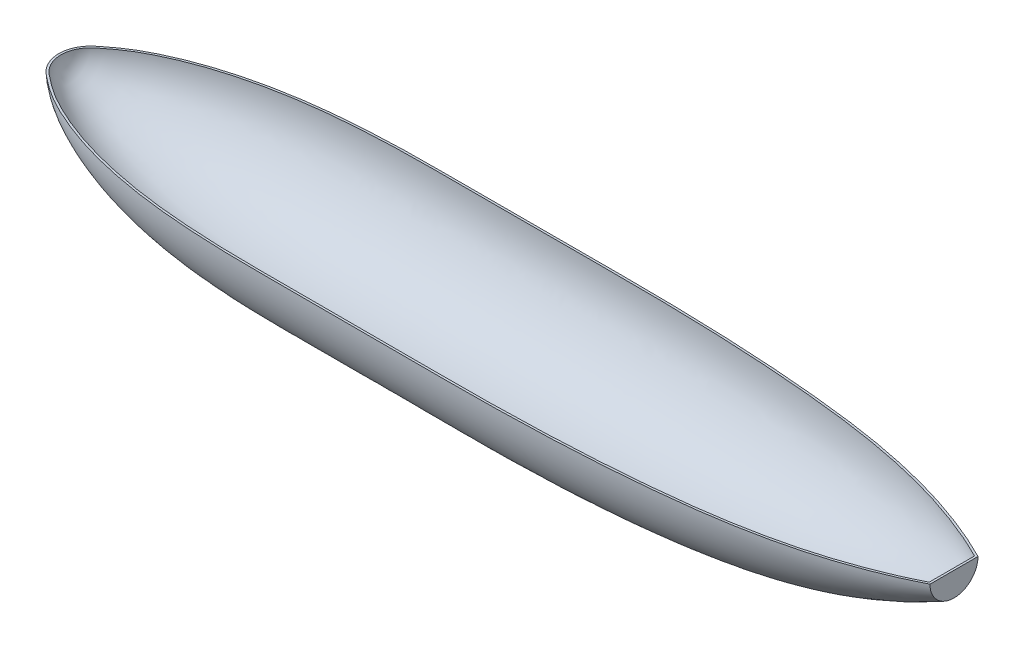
ISO-10303-21;
HEADER;
FILE_DESCRIPTION(('STEP AP214'),'2;1');
FILE_NAME('part.step','',(''),(''),'','','');
FILE_SCHEMA(('AUTOMOTIVE_DESIGN { 1 0 10303 214 1 1 1 1 }'));
ENDSEC;
DATA;
#1=APPLICATION_CONTEXT('core data for automotive mechanical design processes');
#2=APPLICATION_PROTOCOL_DEFINITION('international standard','automotive_design',2000,#1);
#3=PRODUCT_CONTEXT('',#1,'mechanical');
#4=PRODUCT('Part','Part','',(#3));
#5=PRODUCT_RELATED_PRODUCT_CATEGORY('part','',(#4));
#6=PRODUCT_DEFINITION_FORMATION('','',#4);
#7=PRODUCT_DEFINITION_CONTEXT('part definition',#1,'design');
#8=PRODUCT_DEFINITION('design','',#6,#7);
#9=PRODUCT_DEFINITION_SHAPE('','',#8);
#10=(LENGTH_UNIT() NAMED_UNIT(*) SI_UNIT(.MILLI.,.METRE.));
#11=(NAMED_UNIT(*) PLANE_ANGLE_UNIT() SI_UNIT($,.RADIAN.));
#12=(NAMED_UNIT(*) SI_UNIT($,.STERADIAN.) SOLID_ANGLE_UNIT());
#13=UNCERTAINTY_MEASURE_WITH_UNIT(LENGTH_MEASURE(1.E-05),#10,'distance_accuracy_value','');
#14=(GEOMETRIC_REPRESENTATION_CONTEXT(3) GLOBAL_UNCERTAINTY_ASSIGNED_CONTEXT((#13)) GLOBAL_UNIT_ASSIGNED_CONTEXT((#10,
#11,#12)) REPRESENTATION_CONTEXT('',''));
#15=CARTESIAN_POINT('',(0.,0.,0.));
#16=DIRECTION('',(0.,0.,1.));
#17=DIRECTION('',(1.,0.,0.));
#18=AXIS2_PLACEMENT_3D('',#15,#16,#17);
#19=CARTESIAN_POINT('',(1174.75,0.,67.8180000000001));
#20=DIRECTION('',(-1.,0.,0.));
#21=DIRECTION('',(0.,-1.,0.));
#22=AXIS2_PLACEMENT_3D('',#19,#20,#21);
#23=PLANE('',#22);
#24=CARTESIAN_POINT('',(1174.75,0.,0.));
#25=DIRECTION('',(1.,0.,0.));
#26=DIRECTION('',(0.,1.,0.));
#27=AXIS2_PLACEMENT_3D('',#24,#25,#26);
#28=CIRCLE('',#27,71.7691667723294);
#29=CARTESIAN_POINT('',(1174.75,1.08275180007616E-13,71.7691667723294));
#30=VERTEX_POINT('',#29);
#31=CARTESIAN_POINT('',(1174.75,3.94441483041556E-13,-71.7691667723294));
#32=VERTEX_POINT('',#31);
#33=EDGE_CURVE('E11',#30,#32,#28,.T.);
#34=ORIENTED_EDGE('',*,*,#33,.T.);
#35=DIRECTION('',(0.,0.,-1.));
#36=VECTOR('',#35,1.);
#37=CARTESIAN_POINT('',(1174.75,0.,67.8180000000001));
#38=LINE('',#37,#36);
#39=EDGE_CURVE('E86',#30,#32,#38,.T.);
#40=ORIENTED_EDGE('',*,*,#39,.F.);
#41=EDGE_LOOP('',(#34,#40));
#42=FACE_BOUND('',#41,.T.);
#43=ADVANCED_FACE('F37',(#42),#23,.F.);
#44=CARTESIAN_POINT('',(-1498.6,-4.6663381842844E-13,0.874042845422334));
#45=CARTESIAN_POINT('',(-1498.57717291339,-4.63479957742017E-13,1.77654433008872));
#46=CARTESIAN_POINT('',(-1498.55423988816,-4.60237051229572E-13,2.70454585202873));
#47=CARTESIAN_POINT('',(-1498.49944746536,-4.55213785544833E-13,4.14134536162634));
#48=CARTESIAN_POINT('',(-1498.47775521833,-4.53514299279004E-13,4.62733701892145));
#49=CARTESIAN_POINT('',(-1498.4237252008,-4.50065468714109E-13,5.61322686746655));
#50=CARTESIAN_POINT('',(-1498.3916677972,-4.4834202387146E-13,6.10571698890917));
#51=CARTESIAN_POINT('',(-1498.28251040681,-4.43204907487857E-13,7.57321784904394));
#52=CARTESIAN_POINT('',(-1498.19252284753,-4.39818293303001E-13,8.54002702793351));
#53=CARTESIAN_POINT('',(-1497.9853524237,-4.33081596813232E-13,10.4622283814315));
#54=CARTESIAN_POINT('',(-1497.86713380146,-4.29712816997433E-13,11.4229394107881));
#55=CARTESIAN_POINT('',(-1497.46680615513,-4.19609947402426E-13,14.3024767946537));
#56=CARTESIAN_POINT('',(-1497.13805195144,-4.12884401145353E-13,16.2172201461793));
#57=CARTESIAN_POINT('',(-1496.36410662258,-3.99539383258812E-13,20.0122419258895));
#58=CARTESIAN_POINT('',(-1495.91881903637,-3.92906241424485E-13,21.8964322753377));
#59=CARTESIAN_POINT('',(-1494.41167239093,-3.73148234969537E-13,27.502491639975));
#60=CARTESIAN_POINT('',(-1493.17930383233,-3.60173691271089E-13,31.1753265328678));
#61=CARTESIAN_POINT('',(-1490.28109682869,-3.34781808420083E-13,38.3462029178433));
#62=CARTESIAN_POINT('',(-1488.61485041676,-3.22361837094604E-13,41.8449839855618));
#63=CARTESIAN_POINT('',(-1484.86201796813,-2.98251173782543E-13,48.6189290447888));
#64=CARTESIAN_POINT('',(-1482.77570315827,-2.86561883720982E-13,51.893701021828));
#65=CARTESIAN_POINT('',(-1479.335907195,-2.69719521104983E-13,56.5969003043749));
#66=CARTESIAN_POINT('',(-1478.13486384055,-2.64215077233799E-13,58.1313110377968));
#67=CARTESIAN_POINT('',(-1475.65244180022,-2.5354382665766E-13,61.1006116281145));
#68=CARTESIAN_POINT('',(-1474.37191980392,-2.48370048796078E-13,62.5375281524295));
#69=CARTESIAN_POINT('',(-1470.43711494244,-2.33273882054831E-13,66.7232347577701));
#70=CARTESIAN_POINT('',(-1467.68998684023,-2.2377648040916E-13,69.347047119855));
#71=CARTESIAN_POINT('',(-1462.0683491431,-2.05581228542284E-13,74.361203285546));
#72=CARTESIAN_POINT('',(-1459.19361103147,-1.96882605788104E-13,76.751760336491));
#73=CARTESIAN_POINT('',(-1454.86891377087,-1.84192832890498E-13,80.2345728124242));
#74=CARTESIAN_POINT('',(-1453.42519940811,-1.80022780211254E-13,81.3782870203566));
#75=CARTESIAN_POINT('',(-1450.54693634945,-1.71764845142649E-13,83.6425023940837));
#76=CARTESIAN_POINT('',(-1449.1066064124,-1.67658360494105E-13,84.7681286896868));
#77=CARTESIAN_POINT('',(-1444.77299844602,-1.55385933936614E-13,88.1310958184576));
#78=CARTESIAN_POINT('',(-1441.87053814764,-1.47277414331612E-13,90.3516681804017));
#79=CARTESIAN_POINT('',(-1433.11473855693,-1.23201314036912E-13,96.9402392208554));
#80=CARTESIAN_POINT('',(-1427.21297391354,-1.07483112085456E-13,101.235114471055));
#81=CARTESIAN_POINT('',(-1415.23636947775,0.,109.581720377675));
#82=CARTESIAN_POINT('',(-1409.16151892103,0.,113.633451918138));
#83=CARTESIAN_POINT('',(-1399.88672148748,0.,119.492041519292));
#84=CARTESIAN_POINT('',(-1396.76763646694,0.,121.407246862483));
#85=CARTESIAN_POINT('',(-1390.48783047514,0.,125.160053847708));
#86=CARTESIAN_POINT('',(-1387.3261657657,0.,126.998793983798));
#87=CARTESIAN_POINT('',(-1377.78491658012,0.,132.410968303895));
#88=CARTESIAN_POINT('',(-1371.34908965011,0.,135.88036931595));
#89=CARTESIAN_POINT('',(-1358.37521202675,0.,142.589181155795));
#90=CARTESIAN_POINT('',(-1351.83948546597,0.,145.828259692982));
#91=CARTESIAN_POINT('',(-1332.13367354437,0.,155.273671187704));
#92=CARTESIAN_POINT('',(-1318.8455753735,1.15166850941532E-13,161.203741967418));
#93=CARTESIAN_POINT('',(-1292.01447552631,1.57620030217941E-13,172.421745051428));
#94=CARTESIAN_POINT('',(-1278.46986537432,1.77760434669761E-13,177.715123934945));
#95=CARTESIAN_POINT('',(-1251.15912620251,2.15954435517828E-13,187.696426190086));
#96=CARTESIAN_POINT('',(-1237.39429643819,2.33993953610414E-13,192.380362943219));
#97=CARTESIAN_POINT('',(-1195.84334662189,2.8510914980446E-13,205.562981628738));
#98=CARTESIAN_POINT('',(-1167.8010716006,3.15204426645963E-13,213.199057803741));
#99=CARTESIAN_POINT('',(-1125.42679165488,3.55475597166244E-13,223.246944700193));
#100=CARTESIAN_POINT('',(-1111.2496327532,3.68088418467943E-13,226.362150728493));
#101=CARTESIAN_POINT('',(-1082.82190128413,3.91879069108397E-13,232.17898959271));
#102=CARTESIAN_POINT('',(-1068.56953889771,4.03064754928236E-13,234.882809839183));
#103=CARTESIAN_POINT('',(-1039.99655657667,4.2404422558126E-13,239.889399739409));
#104=CARTESIAN_POINT('',(-1025.6764033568,4.33837038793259E-13,242.191907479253));
#105=CARTESIAN_POINT('',(-996.980437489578,4.52050137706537E-13,246.401863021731));
#106=CARTESIAN_POINT('',(-982.603718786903,4.60458983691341E-13,248.306002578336));
#107=CARTESIAN_POINT('',(-953.816595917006,4.75995202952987E-13,251.746071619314));
#108=CARTESIAN_POINT('',(-939.405285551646,4.83133385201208E-13,253.285065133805));
#109=CARTESIAN_POINT('',(-910.56099958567,4.96348592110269E-13,256.058364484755));
#110=CARTESIAN_POINT('',(-896.128984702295,5.02427273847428E-13,257.293178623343));
#111=CARTESIAN_POINT('',(-852.814330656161,5.19358232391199E-13,260.623176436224));
#112=CARTESIAN_POINT('',(-823.905997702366,5.28871115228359E-13,262.333841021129));
#113=CARTESIAN_POINT('',(-766.059001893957,5.44739649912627E-13,264.849838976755));
#114=CARTESIAN_POINT('',(-737.124386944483,5.51075548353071E-13,265.649656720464));
#115=CARTESIAN_POINT('',(-693.728897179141,5.58864662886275E-13,266.358489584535));
#116=CARTESIAN_POINT('',(-679.264594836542,5.61175718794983E-13,266.513079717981));
#117=CARTESIAN_POINT('',(-657.571818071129,5.64300684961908E-13,266.647250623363));
#118=CARTESIAN_POINT('',(-650.341505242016,5.65285403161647E-13,266.675688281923));
#119=CARTESIAN_POINT('',(-639.497253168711,5.66687860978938E-13,266.697015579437));
#120=CARTESIAN_POINT('',(-635.88198615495,5.67142343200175E-13,266.700382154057));
#121=CARTESIAN_POINT('',(-628.655662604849,5.68030833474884E-13,266.701398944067));
#122=CARTESIAN_POINT('',(-625.045912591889,5.68467620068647E-13,266.699890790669));
#123=CARTESIAN_POINT('',(-614.216414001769,5.69790757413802E-13,266.699017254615));
#124=CARTESIAN_POINT('',(-606.994962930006,5.70679071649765E-13,266.700154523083));
#125=CARTESIAN_POINT('',(-592.552721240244,5.72447629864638E-13,266.700140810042));
#126=CARTESIAN_POINT('',(-585.33205305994,5.73331245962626E-13,266.699959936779));
#127=CARTESIAN_POINT('',(-563.669328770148,5.75984384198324E-13,266.700047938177));
#128=CARTESIAN_POINT('',(-549.227477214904,5.77752779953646E-13,266.700001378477));
#129=CARTESIAN_POINT('',(-477.01836180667,5.86595545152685E-13,266.699998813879));
#130=CARTESIAN_POINT('',(-419.251103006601,5.93669790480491E-13,266.700007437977));
#131=CARTESIAN_POINT('',(-347.041968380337,6.0251253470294E-13,266.699998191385));
#132=CARTESIAN_POINT('',(-332.599854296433,6.0428310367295E-13,266.700564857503));
#133=CARTESIAN_POINT('',(-310.937169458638,6.06932746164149E-13,266.699653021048));
#134=CARTESIAN_POINT('',(-303.720195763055,6.07824146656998E-13,266.701831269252));
#135=CARTESIAN_POINT('',(-289.282495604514,6.09638027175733E-13,266.714957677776));
#136=CARTESIAN_POINT('',(-253.186888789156,6.14234865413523E-13,266.765522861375));
#137=CARTESIAN_POINT('',(-217.08457101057,6.19065077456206E-13,266.882693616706));
#138=CARTESIAN_POINT('',(-130.426668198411,6.30511314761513E-13,267.121576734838));
#139=CARTESIAN_POINT('',(-72.6382778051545,6.37947282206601E-13,267.224445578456));
#140=CARTESIAN_POINT('',(42.9685037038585,6.49255522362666E-13,266.408447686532));
#141=CARTESIAN_POINT('',(100.785500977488,6.53087111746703E-13,265.477977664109));
#142=CARTESIAN_POINT('',(187.486460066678,6.54519294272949E-13,262.847209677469));
#143=CARTESIAN_POINT('',(230.827370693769,6.54171395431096E-13,261.227422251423));
#144=CARTESIAN_POINT('',(274.149086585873,6.52247506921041E-13,259.156926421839));
#145=CARTESIAN_POINT('',(303.025427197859,6.5061691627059E-13,257.677093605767));
#146=CARTESIAN_POINT('',(317.461219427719,6.49631837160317E-13,256.888632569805));
#147=CARTESIAN_POINT('',(360.763941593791,6.461119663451E-13,254.361695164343));
#148=CARTESIAN_POINT('',(389.624316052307,6.43002245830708E-13,252.458782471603));
#149=CARTESIAN_POINT('',(432.888547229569,6.36859895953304E-13,249.182086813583));
#150=CARTESIAN_POINT('',(447.305813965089,6.34565810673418E-13,248.01936105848));
#151=CARTESIAN_POINT('',(476.12814429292,6.2943091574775E-13,245.537749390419));
#152=CARTESIAN_POINT('',(504.936318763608,6.23755443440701E-13,242.901806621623));
#153=CARTESIAN_POINT('',(533.715007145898,6.17040179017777E-13,239.969089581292));
#154=CARTESIAN_POINT('',(562.478366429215,6.09825695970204E-13,236.893928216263));
#155=CARTESIAN_POINT('',(576.853762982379,6.05984307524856E-13,235.289505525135));
#156=CARTESIAN_POINT('',(605.594138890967,5.97670148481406E-13,231.900190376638));
#157=CARTESIAN_POINT('',(619.957417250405,5.93192145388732E-13,230.113858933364));
#158=CARTESIAN_POINT('',(648.659982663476,5.83395937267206E-13,226.301393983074));
#159=CARTESIAN_POINT('',(663.000424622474,5.78068384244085E-13,224.272542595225));
#160=CARTESIAN_POINT('',(705.95869144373,5.60601181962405E-13,217.763009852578));
#161=CARTESIAN_POINT('',(734.516140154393,5.47035928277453E-13,212.876136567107));
#162=CARTESIAN_POINT('',(791.426163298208,5.16095574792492E-13,202.018391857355));
#163=CARTESIAN_POINT('',(819.790479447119,4.9871570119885E-13,196.045741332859));
#164=CARTESIAN_POINT('',(876.216588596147,4.59040497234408E-13,182.703207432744));
#165=CARTESIAN_POINT('',(904.277776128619,4.36709361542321E-13,175.323090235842));
#166=CARTESIAN_POINT('',(946.029791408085,3.99040548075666E-13,163.069890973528));
#167=CARTESIAN_POINT('',(959.89129225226,3.85789110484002E-13,158.788345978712));
#168=CARTESIAN_POINT('',(987.481775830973,3.57842625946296E-13,149.816437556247));
#169=CARTESIAN_POINT('',(1014.93879834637,3.28468303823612E-13,140.440260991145));
#170=CARTESIAN_POINT('',(1042.11615685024,2.96349811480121E-13,130.287931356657));
#171=CARTESIAN_POINT('',(1062.38953457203,2.71273655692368E-13,122.3947594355));
#172=CARTESIAN_POINT('',(1069.12821321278,2.62755468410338E-13,119.718698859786));
#173=CARTESIAN_POINT('',(1082.57370889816,2.45369964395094E-13,114.26770051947));
#174=CARTESIAN_POINT('',(1095.98552337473,2.27621510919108E-13,108.713930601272));
#175=CARTESIAN_POINT('',(1109.30334028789,2.0897431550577E-13,102.906047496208));
#176=CARTESIAN_POINT('',(1119.24641809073,1.94586878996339E-13,98.4365746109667));
#177=CARTESIAN_POINT('',(1122.55339160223,1.89720698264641E-13,96.9268549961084));
#178=CARTESIAN_POINT('',(1129.14494264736,1.79872379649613E-13,93.8749898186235));
#179=CARTESIAN_POINT('',(1132.43072001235,1.7489086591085E-13,92.3329809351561));
#180=CARTESIAN_POINT('',(1142.26318905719,1.59813859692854E-13,87.669886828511));
#181=CARTESIAN_POINT('',(1148.78502414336,1.49585953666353E-13,84.5117486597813));
#182=CARTESIAN_POINT('',(1161.7896529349,1.28986910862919E-13,78.1558187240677));
#183=CARTESIAN_POINT('',(1168.27056968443,1.18622179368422E-13,74.9599273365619));
#184=CARTESIAN_POINT('',(1174.75,1.08275180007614E-13,71.769166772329));
#185=B_SPLINE_CURVE_WITH_KNOTS('',3,(#44,#45,#46,#47,#48,#49,#50,#51,#52,#53,#54,#55,#56,#57,
#58,#59,#60,#61,#62,#63,#64,#65,#66,#67,#68,#69,#70,#71,#72,#73,#74,#75,#76,#77,#78,#79,#80,#81,
#82,#83,#84,#85,#86,#87,#88,#89,#90,#91,#92,#93,#94,#95,#96,#97,#98,#99,#100,#101,#102,#103,
#104,#105,#106,#107,#108,#109,#110,#111,#112,#113,#114,#115,#116,#117,#118,#119,#120,#121,#122,
#123,#124,#125,#126,#127,#128,#129,#130,#131,#132,#133,#134,#135,#136,#137,#138,#139,#140,#141,
#142,#143,#144,#145,#146,#147,#148,#149,#150,#151,#152,#153,#154,#155,#156,#157,#158,#159,#160,
#161,#162,#163,#164,#165,#166,#167,#168,#169,#170,#171,#172,#173,#174,#175,#176,#177,#178,#179,
#180,#181,#182,#183,#184),.UNSPECIFIED.,.F.,.F.,(4,2,2,2,2,2,2,2,2,2,2,2,2,2,2,2,2,2,2,2,2,2,2,
2,2,2,2,2,2,2,2,2,2,2,2,2,2,2,2,2,2,2,2,2,2,2,1,2,2,2,1,2,2,2,2,1,2,2,2,2,2,2,2,2,1,2,2,1,2,2,2,
2,4),(0.,0.000976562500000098,0.00146484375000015,0.0019531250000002,0.00292968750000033,
0.00390625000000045,0.00585937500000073,0.00781250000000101,0.0117187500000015,
0.015625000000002,0.0195312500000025,0.0214843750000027,0.0234375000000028,0.0273437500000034,
0.0312500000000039,0.0332031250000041,0.0351562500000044,0.0390625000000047,0.0468750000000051,
0.0546875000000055,0.0585937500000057,0.0625000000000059,0.0703125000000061,0.0781250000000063,
0.0937500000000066,0.109375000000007,0.125000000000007,0.156250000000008,0.171875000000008,
0.187500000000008,0.203125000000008,0.218750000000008,0.234375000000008,0.250000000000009,
0.281250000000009,0.312500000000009,0.32812500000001,0.33593750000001,0.33984375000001,
0.34375000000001,0.35156250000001,0.359375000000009,0.375000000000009,0.437500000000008,
0.453125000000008,0.460937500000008,0.468750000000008,0.500000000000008,0.562500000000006,
0.625000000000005,0.656250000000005,0.671875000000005,0.687500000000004,0.718750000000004,
0.734375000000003,0.750000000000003,0.765625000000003,0.781250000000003,0.796875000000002,
0.812500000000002,0.843750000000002,0.875000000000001,0.906250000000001,0.921875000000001,
0.937500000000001,0.953125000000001,0.9609375,0.96875,0.9765625,0.98046875,0.984375,0.9921875,
1.),.UNSPECIFIED.);
#186=CARTESIAN_POINT('',(1168.4,0.,0.));
#187=DIRECTION('',(1.,0.,0.));
#188=AXIS1_PLACEMENT('',#186,#187);
#189=SURFACE_OF_REVOLUTION('',#185,#188);
#190=CARTESIAN_POINT('',(-1498.6,-3.26602514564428E-13,0.));
#191=DIRECTION('',(1.,0.,0.));
#192=DIRECTION('',(0.,1.,0.));
#193=AXIS2_PLACEMENT_3D('',#190,#191,#192);
#194=CIRCLE('',#193,0.874042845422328);
#195=CARTESIAN_POINT('',(-1498.6,-4.66200137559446E-13,0.874042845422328));
#196=VERTEX_POINT('',#195);
#197=CARTESIAN_POINT('',(-1498.6,-1.80901483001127E-13,-0.874042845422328));
#198=VERTEX_POINT('',#197);
#199=EDGE_CURVE('E46',#196,#198,#194,.T.);
#200=ORIENTED_EDGE('',*,*,#199,.T.);
#201=CARTESIAN_POINT('',(-1498.6,-1.80467802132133E-13,-0.874042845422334));
#202=CARTESIAN_POINT('',(-1498.57717291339,-1.77313937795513E-13,-1.77654433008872));
#203=CARTESIAN_POINT('',(-1498.55423988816,-1.74071027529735E-13,-2.70454585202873));
#204=CARTESIAN_POINT('',(-1498.49944746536,-1.69047756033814E-13,-4.14134536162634));
#205=CARTESIAN_POINT('',(-1498.47775521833,-1.67348267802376E-13,-4.62733701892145));
#206=CARTESIAN_POINT('',(-1498.4237252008,-1.63899433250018E-13,-5.61322686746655));
#207=CARTESIAN_POINT('',(-1498.3916677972,-1.62175986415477E-13,-6.10571698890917));
#208=CARTESIAN_POINT('',(-1498.28251040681,-1.57038864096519E-13,-7.57321784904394));
#209=CARTESIAN_POINT('',(-1498.19252284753,-1.53652246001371E-13,-8.54002702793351));
#210=CARTESIAN_POINT('',(-1497.9853524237,-1.46915541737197E-13,-10.4622283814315));
#211=CARTESIAN_POINT('',(-1497.86713380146,-1.43546758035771E-13,-11.4229394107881));
#212=CARTESIAN_POINT('',(-1497.46680615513,-1.33443876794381E-13,-14.3024767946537));
#213=CARTESIAN_POINT('',(-1497.13805195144,-1.26718322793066E-13,-16.2172201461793));
#214=CARTESIAN_POINT('',(-1496.36410662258,-1.13373289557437E-13,-20.0122419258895));
#215=CARTESIAN_POINT('',(-1495.91881903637,-1.0674014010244E-13,-21.8964322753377));
#216=CARTESIAN_POINT('',(-1494.41167239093,0.,-27.502491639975));
#217=CARTESIAN_POINT('',(-1493.17930383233,0.,-31.1753265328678));
#218=CARTESIAN_POINT('',(-1490.28109682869,0.,-38.3462029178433));
#219=CARTESIAN_POINT('',(-1488.61485041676,0.,-41.8449839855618));
#220=CARTESIAN_POINT('',(-1484.86201796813,0.,-48.6189290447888));
#221=CARTESIAN_POINT('',(-1482.77570315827,0.,-51.893701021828));
#222=CARTESIAN_POINT('',(-1479.335907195,0.,-56.5969003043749));
#223=CARTESIAN_POINT('',(-1478.13486384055,0.,-58.1313110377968));
#224=CARTESIAN_POINT('',(-1475.65244180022,0.,-61.1006116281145));
#225=CARTESIAN_POINT('',(-1474.37191980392,0.,-62.5375281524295));
#226=CARTESIAN_POINT('',(-1470.43711494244,0.,-66.7232347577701));
#227=CARTESIAN_POINT('',(-1467.68998684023,0.,-69.347047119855));
#228=CARTESIAN_POINT('',(-1462.0683491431,0.,-74.361203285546));
#229=CARTESIAN_POINT('',(-1459.19361103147,0.,-76.751760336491));
#230=CARTESIAN_POINT('',(-1454.86891377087,1.01973504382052E-13,-80.2345728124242));
#231=CARTESIAN_POINT('',(-1453.42519940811,1.06143561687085E-13,-81.3782870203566));
#232=CARTESIAN_POINT('',(-1450.54693634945,1.14401505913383E-13,-83.6425023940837));
#233=CARTESIAN_POINT('',(-1449.1066064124,1.18507995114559E-13,-84.7681286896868));
#234=CARTESIAN_POINT('',(-1444.77299844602,1.3078043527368E-13,-88.1310958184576));
#235=CARTESIAN_POINT('',(-1441.87053814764,1.38888963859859E-13,-90.3516681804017));
#236=CARTESIAN_POINT('',(-1433.11473855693,1.62965090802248E-13,-96.9402392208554));
#237=CARTESIAN_POINT('',(-1427.21297391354,1.78683310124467E-13,-101.235114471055));
#238=CARTESIAN_POINT('',(-1415.23636947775,2.09292008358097E-13,-109.581720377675));
#239=CARTESIAN_POINT('',(-1409.16151892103,2.24182491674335E-13,-113.633451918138));
#240=CARTESIAN_POINT('',(-1399.88672148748,2.45773457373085E-13,-119.492041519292));
#241=CARTESIAN_POINT('',(-1396.76763646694,2.52842330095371E-13,-121.407246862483));
#242=CARTESIAN_POINT('',(-1390.48783047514,2.66714222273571E-13,-125.160053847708));
#243=CARTESIAN_POINT('',(-1387.3261657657,2.73521332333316E-13,-126.998793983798));
#244=CARTESIAN_POINT('',(-1377.78491658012,2.93586276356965E-13,-132.410968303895));
#245=CARTESIAN_POINT('',(-1371.34908965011,3.06487767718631E-13,-135.88036931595));
#246=CARTESIAN_POINT('',(-1358.37521202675,3.31500261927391E-13,-142.589181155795));
#247=CARTESIAN_POINT('',(-1351.83948546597,3.43609819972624E-13,-145.828259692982));
#248=CARTESIAN_POINT('',(-1332.13367354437,3.79001503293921E-13,-155.273671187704));
#249=CARTESIAN_POINT('',(-1318.8455753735,4.01333515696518E-13,-161.203741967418));
#250=CARTESIAN_POINT('',(-1292.01447552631,4.43786740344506E-13,-172.421745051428));
#251=CARTESIAN_POINT('',(-1278.46986537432,4.63927166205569E-13,-177.715123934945));
#252=CARTESIAN_POINT('',(-1251.15912620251,5.02121207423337E-13,-187.696426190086));
#253=CARTESIAN_POINT('',(-1237.39429643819,5.20160744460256E-13,-192.380362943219));
#254=CARTESIAN_POINT('',(-1195.84334662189,5.71275993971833E-13,-205.562981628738));
#255=CARTESIAN_POINT('',(-1167.8010716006,6.01371301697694E-13,-213.199057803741));
#256=CARTESIAN_POINT('',(-1125.42679165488,6.4164251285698E-13,-223.246944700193));
#257=CARTESIAN_POINT('',(-1111.2496327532,6.54255346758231E-13,-226.362150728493));
#258=CARTESIAN_POINT('',(-1082.82190128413,6.78046020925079E-13,-232.17898959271));
#259=CARTESIAN_POINT('',(-1068.56953889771,6.89231717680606E-13,-234.882809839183));
#260=CARTESIAN_POINT('',(-1039.99655657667,7.10211208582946E-13,-239.889399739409));
#261=CARTESIAN_POINT('',(-1025.6764033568,7.20004031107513E-13,-242.191907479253));
#262=CARTESIAN_POINT('',(-996.980437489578,7.38217147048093E-13,-246.401863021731));
#263=CARTESIAN_POINT('',(-982.603718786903,7.46626000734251E-13,-248.306002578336));
#264=CARTESIAN_POINT('',(-953.816595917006,7.62162233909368E-13,-251.746071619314));
#265=CARTESIAN_POINT('',(-939.405285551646,7.69300422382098E-13,-253.285065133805));
#266=CARTESIAN_POINT('',(-910.56099958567,7.82515640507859E-13,-256.058364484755));
#267=CARTESIAN_POINT('',(-896.128984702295,7.88594327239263E-13,-257.293178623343));
#268=CARTESIAN_POINT('',(-852.814330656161,8.05525299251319E-13,-260.623176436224));
#269=CARTESIAN_POINT('',(-823.905997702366,8.15038189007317E-13,-262.333841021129));
#270=CARTESIAN_POINT('',(-766.059001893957,8.30906733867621E-13,-264.849838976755));
#271=CARTESIAN_POINT('',(-737.124386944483,8.37242635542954E-13,-265.649656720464));
#272=CARTESIAN_POINT('',(-693.728897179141,8.45031752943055E-13,-266.358489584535));
#273=CARTESIAN_POINT('',(-679.264594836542,8.47342809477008E-13,-266.513079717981));
#274=CARTESIAN_POINT('',(-657.571818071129,8.50467776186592E-13,-266.647250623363));
#275=CARTESIAN_POINT('',(-650.341505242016,8.51452494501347E-13,-266.675688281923));
#276=CARTESIAN_POINT('',(-639.497253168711,8.52854952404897E-13,-266.697015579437));
#277=CARTESIAN_POINT('',(-635.88198615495,8.53309434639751E-13,-266.700382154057));
#278=CARTESIAN_POINT('',(-628.655662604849,8.54197924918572E-13,-266.701398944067));
#279=CARTESIAN_POINT('',(-625.045912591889,8.54634711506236E-13,-266.699890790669));
#280=CARTESIAN_POINT('',(-614.216414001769,8.55957848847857E-13,-266.699017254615));
#281=CARTESIAN_POINT('',(-606.994962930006,8.5684616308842E-13,-266.700154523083));
#282=CARTESIAN_POINT('',(-592.552721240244,8.58614721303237E-13,-266.700140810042));
#283=CARTESIAN_POINT('',(-585.33205305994,8.59498337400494E-13,-266.699959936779));
#284=CARTESIAN_POINT('',(-563.669328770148,8.62151475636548E-13,-266.700047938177));
#285=CARTESIAN_POINT('',(-549.227477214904,8.63919871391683E-13,-266.700001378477));
#286=CARTESIAN_POINT('',(-477.01836180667,8.7276263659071E-13,-266.699998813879));
#287=CARTESIAN_POINT('',(-419.251103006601,8.79836881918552E-13,-266.700007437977));
#288=CARTESIAN_POINT('',(-347.041968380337,8.88679626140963E-13,-266.699998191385));
#289=CARTESIAN_POINT('',(-332.599854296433,8.90450195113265E-13,-266.700564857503));
#290=CARTESIAN_POINT('',(-310.937169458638,8.93099837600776E-13,-266.699653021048));
#291=CARTESIAN_POINT('',(-303.720195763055,8.93991238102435E-13,-266.701831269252));
#292=CARTESIAN_POINT('',(-289.282495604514,8.9580511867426E-13,-266.714957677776));
#293=CARTESIAN_POINT('',(-253.186888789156,9.00401957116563E-13,-266.765522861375));
#294=CARTESIAN_POINT('',(-217.08457101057,9.05232169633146E-13,-266.882693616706));
#295=CARTESIAN_POINT('',(-130.426668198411,9.16678407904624E-13,-267.121576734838));
#296=CARTESIAN_POINT('',(-72.6382778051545,9.24114375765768E-13,-267.224445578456));
#297=CARTESIAN_POINT('',(42.9685037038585,9.35422612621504E-13,-266.408447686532));
#298=CARTESIAN_POINT('',(100.785500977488,9.39254198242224E-13,-265.477977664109));
#299=CARTESIAN_POINT('',(187.486460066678,9.40686370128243E-13,-262.847209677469));
#300=CARTESIAN_POINT('',(230.827370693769,9.40338464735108E-13,-261.227422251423));
#301=CARTESIAN_POINT('',(274.149086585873,9.38414567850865E-13,-259.156926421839));
#302=CARTESIAN_POINT('',(303.025427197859,9.36783971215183E-13,-257.677093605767));
#303=CARTESIAN_POINT('',(317.461219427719,9.35798888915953E-13,-256.888632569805));
#304=CARTESIAN_POINT('',(360.763941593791,9.32279007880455E-13,-254.361695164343));
#305=CARTESIAN_POINT('',(389.624316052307,9.29169279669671E-13,-252.458782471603));
#306=CARTESIAN_POINT('',(432.888547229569,9.23026916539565E-13,-249.182086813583));
#307=CARTESIAN_POINT('',(447.305813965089,9.20732826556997E-13,-248.01936105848));
#308=CARTESIAN_POINT('',(476.12814429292,9.1559792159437E-13,-245.537749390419));
#309=CARTESIAN_POINT('',(504.936318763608,9.09922438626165E-13,-242.901806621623));
#310=CARTESIAN_POINT('',(533.715007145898,9.03207162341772E-13,-239.969089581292));
#311=CARTESIAN_POINT('',(562.478366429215,8.95992666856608E-13,-236.893928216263));
#312=CARTESIAN_POINT('',(576.853762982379,8.92151271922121E-13,-235.289505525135));
#313=CARTESIAN_POINT('',(605.594138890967,8.83837099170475E-13,-231.900190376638));
#314=CARTESIAN_POINT('',(619.957417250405,8.79359088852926E-13,-230.113858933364));
#315=CARTESIAN_POINT('',(648.659982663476,8.69562865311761E-13,-226.301393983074));
#316=CARTESIAN_POINT('',(663.000424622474,8.64235304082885E-13,-224.272542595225));
#317=CARTESIAN_POINT('',(705.95869144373,8.46768075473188E-13,-217.763009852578));
#318=CARTESIAN_POINT('',(734.516140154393,8.33202802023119E-13,-212.876136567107));
#319=CARTESIAN_POINT('',(791.426163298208,8.02262404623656E-13,-202.018391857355));
#320=CARTESIAN_POINT('',(819.790479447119,7.84882506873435E-13,-196.045741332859));
#321=CARTESIAN_POINT('',(876.216588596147,7.45207248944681E-13,-182.703207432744));
#322=CARTESIAN_POINT('',(904.277776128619,7.2287608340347E-13,-175.323090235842));
#323=CARTESIAN_POINT('',(946.029791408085,6.85207220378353E-13,-163.069890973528));
#324=CARTESIAN_POINT('',(959.89129225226,6.71955765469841E-13,-158.788345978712));
#325=CARTESIAN_POINT('',(987.481775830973,6.4400924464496E-13,-149.816437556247));
#326=CARTESIAN_POINT('',(1014.93879834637,6.14634884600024E-13,-140.440260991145));
#327=CARTESIAN_POINT('',(1042.11615685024,5.82516351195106E-13,-130.287931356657));
#328=CARTESIAN_POINT('',(1062.38953457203,5.57440163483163E-13,-122.3947594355));
#329=CARTESIAN_POINT('',(1069.12821321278,5.4892196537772E-13,-119.718698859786));
#330=CARTESIAN_POINT('',(1082.57370889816,5.31536439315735E-13,-114.26770051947));
#331=CARTESIAN_POINT('',(1095.98552337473,5.13787963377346E-13,-108.713930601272));
#332=CARTESIAN_POINT('',(1109.30334028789,4.95140744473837E-13,-102.906047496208));
#333=CARTESIAN_POINT('',(1119.24641809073,4.80753289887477E-13,-98.4365746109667));
#334=CARTESIAN_POINT('',(1122.55339160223,4.75887103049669E-13,-96.9268549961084));
#335=CARTESIAN_POINT('',(1129.14494264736,4.66038772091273E-13,-93.8749898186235));
#336=CARTESIAN_POINT('',(1132.43072001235,4.61057252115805E-13,-92.3329809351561));
#337=CARTESIAN_POINT('',(1142.26318905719,4.45980227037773E-13,-87.669886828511));
#338=CARTESIAN_POINT('',(1148.78502414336,4.3575230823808E-13,-84.5117486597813));
#339=CARTESIAN_POINT('',(1161.7896529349,4.15153239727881E-13,-78.1558187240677));
#340=CARTESIAN_POINT('',(1168.27056968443,4.04788495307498E-13,-74.9599273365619));
#341=CARTESIAN_POINT('',(1174.75,3.94441483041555E-13,-71.769166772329));
#342=B_SPLINE_CURVE_WITH_KNOTS('',3,(#201,#202,#203,#204,#205,#206,#207,#208,#209,#210,#211,
#212,#213,#214,#215,#216,#217,#218,#219,#220,#221,#222,#223,#224,#225,#226,#227,#228,#229,#230,
#231,#232,#233,#234,#235,#236,#237,#238,#239,#240,#241,#242,#243,#244,#245,#246,#247,#248,#249,
#250,#251,#252,#253,#254,#255,#256,#257,#258,#259,#260,#261,#262,#263,#264,#265,#266,#267,#268,
#269,#270,#271,#272,#273,#274,#275,#276,#277,#278,#279,#280,#281,#282,#283,#284,#285,#286,#287,
#288,#289,#290,#291,#292,#293,#294,#295,#296,#297,#298,#299,#300,#301,#302,#303,#304,#305,#306,
#307,#308,#309,#310,#311,#312,#313,#314,#315,#316,#317,#318,#319,#320,#321,#322,#323,#324,#325,
#326,#327,#328,#329,#330,#331,#332,#333,#334,#335,#336,#337,#338,#339,#340,#341),.UNSPECIFIED.,
.F.,.F.,(4,2,2,2,2,2,2,2,2,2,2,2,2,2,2,2,2,2,2,2,2,2,2,2,2,2,2,2,2,2,2,2,2,2,2,2,2,2,2,2,2,2,2,
2,2,2,1,2,2,2,1,2,2,2,2,1,2,2,2,2,2,2,2,2,1,2,2,1,2,2,2,2,4),(0.,0.000976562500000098,
0.00146484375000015,0.0019531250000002,0.00292968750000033,0.00390625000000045,
0.00585937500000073,0.00781250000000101,0.0117187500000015,0.015625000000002,0.0195312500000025,
0.0214843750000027,0.0234375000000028,0.0273437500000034,0.0312500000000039,0.0332031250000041,
0.0351562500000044,0.0390625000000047,0.0468750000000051,0.0546875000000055,0.0585937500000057,
0.0625000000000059,0.0703125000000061,0.0781250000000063,0.0937500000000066,0.109375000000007,
0.125000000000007,0.156250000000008,0.171875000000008,0.187500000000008,0.203125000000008,
0.218750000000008,0.234375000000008,0.250000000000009,0.281250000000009,0.312500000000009,
0.32812500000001,0.33593750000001,0.33984375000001,0.34375000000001,0.35156250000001,
0.359375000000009,0.375000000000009,0.437500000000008,0.453125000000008,0.460937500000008,
0.468750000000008,0.500000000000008,0.562500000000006,0.625000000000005,0.656250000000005,
0.671875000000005,0.687500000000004,0.718750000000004,0.734375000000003,0.750000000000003,
0.765625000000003,0.781250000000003,0.796875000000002,0.812500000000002,0.843750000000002,
0.875000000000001,0.906250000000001,0.921875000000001,0.937500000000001,0.953125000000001,
0.9609375,0.96875,0.9765625,0.98046875,0.984375,0.9921875,1.),.UNSPECIFIED.);
#343=EDGE_CURVE('E99',#198,#32,#342,.T.);
#344=ORIENTED_EDGE('',*,*,#343,.T.);
#345=ORIENTED_EDGE('',*,*,#33,.F.);
#346=EDGE_CURVE('E93',#196,#30,#185,.T.);
#347=ORIENTED_EDGE('',*,*,#346,.F.);
#348=EDGE_LOOP('',(#200,#344,#345,#347));
#349=FACE_BOUND('',#348,.T.);
#350=ADVANCED_FACE('F39',(#349),#189,.T.);
#351=CARTESIAN_POINT('',(-1498.6,-4.69685520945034E-13,1.4230538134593E-13));
#352=DIRECTION('',(1.,0.,0.));
#353=DIRECTION('',(0.,1.,0.));
#354=AXIS2_PLACEMENT_3D('',#351,#352,#353);
#355=PLANE('',#354);
#356=DIRECTION('',(0.,0.,-1.));
#357=VECTOR('',#356,1.);
#358=CARTESIAN_POINT('',(-1498.6,-4.69685520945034E-13,1.4230538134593E-13));
#359=LINE('',#358,#357);
#360=EDGE_CURVE('E151',#198,#196,#359,.F.);
#361=ORIENTED_EDGE('',*,*,#360,.F.);
#362=ORIENTED_EDGE('',*,*,#199,.F.);
#363=EDGE_LOOP('',(#361,#362));
#364=FACE_BOUND('',#363,.T.);
#365=ADVANCED_FACE('F129',(#364),#355,.F.);
#366=CARTESIAN_POINT('',(-1492.25,-4.68907895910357E-13,1.43083006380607E-13));
#367=DIRECTION('',(1.,0.,0.));
#368=DIRECTION('',(0.,1.,0.));
#369=AXIS2_PLACEMENT_3D('',#366,#367,#368);
#370=PLANE('',#369);
#371=CARTESIAN_POINT('',(-1492.25,-3.25824889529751E-13,0.));
#372=DIRECTION('',(1.,0.,0.));
#373=DIRECTION('',(0.,1.,0.));
#374=AXIS2_PLACEMENT_3D('',#371,#372,#373);
#375=CIRCLE('',#374,0.793750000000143);
#376=CARTESIAN_POINT('',(-1492.25,-4.66136534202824E-13,0.793750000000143));
#377=VERTEX_POINT('',#376);
#378=CARTESIAN_POINT('',(-1492.25,-1.79970518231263E-13,-0.793750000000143));
#379=VERTEX_POINT('',#378);
#380=EDGE_CURVE('E92',#377,#379,#375,.T.);
#381=ORIENTED_EDGE('',*,*,#380,.T.);
#382=DIRECTION('',(0.,0.,1.));
#383=VECTOR('',#382,1.);
#384=CARTESIAN_POINT('',(-1492.25,-4.68907895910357E-13,1.43083006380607E-13));
#385=LINE('',#384,#383);
#386=EDGE_CURVE('E97',#379,#377,#385,.T.);
#387=ORIENTED_EDGE('',*,*,#386,.T.);
#388=EDGE_LOOP('',(#381,#387));
#389=FACE_BOUND('',#388,.T.);
#390=ADVANCED_FACE('F126',(#389),#370,.T.);
#391=CARTESIAN_POINT('',(-1492.25,-4.66136534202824E-13,0.793750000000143));
#392=CARTESIAN_POINT('',(-1492.21582639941,-4.61415004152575E-13,2.14485212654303));
#393=CARTESIAN_POINT('',(-1492.15078911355,-4.52429252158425E-13,4.71619414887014));
#394=CARTESIAN_POINT('',(-1491.8134288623,-4.38297905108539E-13,8.75174252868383));
#395=CARTESIAN_POINT('',(-1491.27507361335,-4.2365949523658E-13,12.925469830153));
#396=CARTESIAN_POINT('',(-1490.40677768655,-4.07002937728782E-13,17.6656455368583));
#397=CARTESIAN_POINT('',(-1489.19784787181,-3.89473131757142E-13,22.6439822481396));
#398=CARTESIAN_POINT('',(-1487.61805663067,-3.71406409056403E-13,27.7630904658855));
#399=CARTESIAN_POINT('',(-1485.7000462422,-3.53296381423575E-13,32.8827389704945));
#400=CARTESIAN_POINT('',(-1483.25058427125,-3.3385654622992E-13,38.3646195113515));
#401=CARTESIAN_POINT('',(-1480.22025005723,-3.13742390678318E-13,44.0192595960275));
#402=CARTESIAN_POINT('',(-1476.79485787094,-2.94606343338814E-13,49.3799018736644));
#403=CARTESIAN_POINT('',(-1467.46570449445,-2.49691291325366E-13,61.9168794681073));
#404=CARTESIAN_POINT('',(-1440.70498590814,-1.69867899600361E-13,83.8406115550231));
#405=CARTESIAN_POINT('',(-1399.04342763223,0.,114.177065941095));
#406=CARTESIAN_POINT('',(-1347.14684056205,0.,141.77560733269));
#407=CARTESIAN_POINT('',(-1296.02361845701,1.29151052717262E-13,164.408518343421));
#408=CARTESIAN_POINT('',(-1245.06850637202,2.01999138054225E-13,183.48584456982));
#409=CARTESIAN_POINT('',(-1177.60031716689,2.84196329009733E-13,204.661680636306));
#410=CARTESIAN_POINT('',(-1092.92614512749,3.65005690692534E-13,224.836541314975));
#411=CARTESIAN_POINT('',(-991.026676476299,4.36880700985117E-13,241.848338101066));
#412=CARTESIAN_POINT('',(-889.176798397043,4.85356685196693E-13,252.160122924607));
#413=CARTESIAN_POINT('',(-770.569527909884,5.24350183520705E-13,259.168263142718));
#414=CARTESIAN_POINT('',(-682.336944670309,5.39351264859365E-13,260.370064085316));
#415=CARTESIAN_POINT('',(-622.15321345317,5.46646116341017E-13,260.348501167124));
#416=CARTESIAN_POINT('',(-606.614810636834,5.48555991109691E-13,260.350515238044));
#417=CARTESIAN_POINT('',(-590.183466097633,5.50566053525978E-13,260.349905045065));
#418=CARTESIAN_POINT('',(-574.264917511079,5.52515876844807E-13,260.350027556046));
#419=CARTESIAN_POINT('',(-559.630951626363,5.54307840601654E-13,260.349992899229));
#420=CARTESIAN_POINT('',(-542.301096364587,5.56430100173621E-13,260.350002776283));
#421=CARTESIAN_POINT('',(-525.486068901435,5.5848926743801E-13,260.349999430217));
#422=CARTESIAN_POINT('',(-508.543111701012,5.6056411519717E-13,260.350000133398));
#423=CARTESIAN_POINT('',(-494.937919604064,5.62230215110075E-13,260.349999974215));
#424=CARTESIAN_POINT('',(-481.71664822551,5.63849300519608E-13,260.350000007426));
#425=CARTESIAN_POINT('',(-468.238709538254,5.65499817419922E-13,260.34999999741));
#426=CARTESIAN_POINT('',(-454.760576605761,5.67150358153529E-13,260.35000000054));
#427=CARTESIAN_POINT('',(-441.539809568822,5.68769381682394E-13,260.349999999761));
#428=CARTESIAN_POINT('',(-428.575328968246,5.70357020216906E-13,260.350000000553));
#429=CARTESIAN_POINT('',(-415.226602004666,5.71991713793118E-13,260.349999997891));
#430=CARTESIAN_POINT('',(-401.235508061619,5.73705072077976E-13,260.350000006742));
#431=CARTESIAN_POINT('',(-389.428230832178,5.75150998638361E-13,260.349999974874));
#432=CARTESIAN_POINT('',(-378.51565674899,5.76487359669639E-13,260.35000005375));
#433=CARTESIAN_POINT('',(-369.786879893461,5.77556290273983E-13,260.349999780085));
#434=CARTESIAN_POINT('',(-360.031805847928,5.78750906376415E-13,260.350000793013));
#435=CARTESIAN_POINT('',(-350.661466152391,5.79898387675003E-13,260.349996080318));
#436=CARTESIAN_POINT('',(-341.037066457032,5.81077048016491E-13,260.350010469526));
#437=CARTESIAN_POINT('',(-330.898025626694,5.82318471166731E-13,260.349950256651));
#438=CARTESIAN_POINT('',(-321.399734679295,5.83482594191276E-13,260.35022414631));
#439=CARTESIAN_POINT('',(-210.628623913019,5.9702067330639E-13,260.34248487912));
#440=CARTESIAN_POINT('',(-53.4082296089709,6.2095454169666E-13,261.683051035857));
#441=CARTESIAN_POINT('',(152.454222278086,6.33945213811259E-13,258.183281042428));
#442=CARTESIAN_POINT('',(304.904766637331,6.30388089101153E-13,251.81740766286));
#443=CARTESIAN_POINT('',(440.424590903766,6.15733598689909E-13,242.866951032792));
#444=CARTESIAN_POINT('',(558.943042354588,5.89745406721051E-13,231.266699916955));
#445=CARTESIAN_POINT('',(660.714412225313,5.59114798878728E-13,218.924196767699));
#446=CARTESIAN_POINT('',(762.460038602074,5.12061797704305E-13,201.879033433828));
#447=CARTESIAN_POINT('',(864.37341299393,4.48155461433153E-13,180.000996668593));
#448=CARTESIAN_POINT('',(966.359094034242,3.60628953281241E-13,151.355333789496));
#449=CARTESIAN_POINT('',(1050.69033612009,2.64649856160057E-13,120.907966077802));
#450=CARTESIAN_POINT('',(1118.18156361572,1.7389593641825E-13,92.5477985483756));
#451=CARTESIAN_POINT('',(1151.54570991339,1.20616746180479E-13,76.1178043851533));
#452=CARTESIAN_POINT('',(1168.4,0.,67.8180000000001));
#453=B_SPLINE_CURVE_WITH_KNOTS('',3,(#391,#392,#393,#394,#395,#396,#397,#398,#399,#400,#401,
#402,#403,#404,#405,#406,#407,#408,#409,#410,#411,#412,#413,#414,#415,#416,#417,#418,#419,#420,
#421,#422,#423,#424,#425,#426,#427,#428,#429,#430,#431,#432,#433,#434,#435,#436,#437,#438,#439,
#440,#441,#442,#443,#444,#445,#446,#447,#448,#449,#450,#451,#452),.UNSPECIFIED.,.F.,.F.,(4,1,1,
1,1,1,1,1,1,1,1,1,1,1,1,1,1,1,1,1,1,1,1,1,1,1,1,1,1,1,1,1,1,1,1,1,1,1,1,1,1,1,1,1,1,1,1,1,1,1,1,
1,1,1,1,1,1,1,1,4),(0.,0.00146410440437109,0.00278640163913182,0.00438570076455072,
0.00602205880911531,0.00800541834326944,0.00993284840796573,0.0118232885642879,
0.0139257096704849,0.0164340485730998,0.0187666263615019,0.0208135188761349,0.033341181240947,
0.0558426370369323,0.0767378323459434,0.0968197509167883,0.116414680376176,0.135650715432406,
0.173408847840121,0.210614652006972,0.247510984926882,0.284271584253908,0.339322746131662,
0.343083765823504,0.349481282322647,0.356158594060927,0.360887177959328,0.36672906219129,
0.372014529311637,0.379664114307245,0.384948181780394,0.390372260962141,0.394405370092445,
0.399273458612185,0.404975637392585,0.409008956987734,0.413598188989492,0.419022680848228,
0.423472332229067,0.428757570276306,0.431815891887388,0.435296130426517,0.43821521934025,
0.442385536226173,0.445448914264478,0.448643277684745,0.453371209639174,0.455740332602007,
0.568664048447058,0.623715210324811,0.678804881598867,0.733975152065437,0.770843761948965,
0.807823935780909,0.84502973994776,0.882582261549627,0.92071299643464,0.959712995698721,
0.979648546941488,1.),.UNSPECIFIED.);
#454=CARTESIAN_POINT('',(1168.4,0.,0.));
#455=DIRECTION('',(1.,0.,0.));
#456=AXIS1_PLACEMENT('',#454,#455);
#457=SURFACE_OF_REVOLUTION('',#453,#456);
#458=CARTESIAN_POINT('',(1168.4,0.,0.));
#459=DIRECTION('',(1.,0.,0.));
#460=DIRECTION('',(0.,1.,0.));
#461=AXIS2_PLACEMENT_3D('',#458,#459,#460);
#462=CIRCLE('',#461,67.8180000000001);
#463=CARTESIAN_POINT('',(1168.4,0.,67.8180000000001));
#464=VERTEX_POINT('',#463);
#465=CARTESIAN_POINT('',(1168.4,3.79868424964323E-13,-67.8180000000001));
#466=VERTEX_POINT('',#465);
#467=EDGE_CURVE('E80',#464,#466,#462,.T.);
#468=ORIENTED_EDGE('',*,*,#467,.T.);
#469=CARTESIAN_POINT('',(-1492.25,-1.79970518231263E-13,-0.793750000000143));
#470=CARTESIAN_POINT('',(-1492.21582639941,-1.75248982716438E-13,-2.14485212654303));
#471=CARTESIAN_POINT('',(-1492.15078911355,-1.66263220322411E-13,-4.71619414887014));
#472=CARTESIAN_POINT('',(-1491.8134288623,-1.52131856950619E-13,-8.75174252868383));
#473=CARTESIAN_POINT('',(-1491.27507361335,-1.37493430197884E-13,-12.925469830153));
#474=CARTESIAN_POINT('',(-1490.40677768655,-1.20836853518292E-13,-17.6656455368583));
#475=CARTESIAN_POINT('',(-1489.19784787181,-1.03307027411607E-13,-22.6439822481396));
#476=CARTESIAN_POINT('',(-1487.61805663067,0.,-27.7630904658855));
#477=CARTESIAN_POINT('',(-1485.7000462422,0.,-32.8827389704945));
#478=CARTESIAN_POINT('',(-1483.25058427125,0.,-38.3646195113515));
#479=CARTESIAN_POINT('',(-1480.22025005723,0.,-44.0192595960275));
#480=CARTESIAN_POINT('',(-1476.79485787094,0.,-49.3799018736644));
#481=CARTESIAN_POINT('',(-1467.46570449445,0.,-61.9168794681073));
#482=CARTESIAN_POINT('',(-1440.70498590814,1.1629845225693E-13,-83.8406115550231));
#483=CARTESIAN_POINT('',(-1399.04342763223,2.27319578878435E-13,-114.177065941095));
#484=CARTESIAN_POINT('',(-1347.14684056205,3.30034715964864E-13,-141.77560733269));
#485=CARTESIAN_POINT('',(-1296.02361845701,4.1531773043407E-13,-164.408518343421));
#486=CARTESIAN_POINT('',(-1245.06850637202,4.88165892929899E-13,-183.48584456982));
#487=CARTESIAN_POINT('',(-1177.60031716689,5.70363169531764E-13,-204.661680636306));
#488=CARTESIAN_POINT('',(-1092.92614512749,6.51172612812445E-13,-224.836541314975));
#489=CARTESIAN_POINT('',(-991.026676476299,7.23047691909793E-13,-241.848338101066));
#490=CARTESIAN_POINT('',(-889.176798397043,7.71523717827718E-13,-252.160122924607));
#491=CARTESIAN_POINT('',(-770.569527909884,8.10517244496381E-13,-259.168263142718));
#492=CARTESIAN_POINT('',(-682.336944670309,8.25518330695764E-13,-260.370064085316));
#493=CARTESIAN_POINT('',(-622.15321345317,8.32813182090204E-13,-260.348501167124));
#494=CARTESIAN_POINT('',(-606.614810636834,8.34723056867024E-13,-260.350515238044));
#495=CARTESIAN_POINT('',(-590.183466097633,8.36733119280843E-13,-260.349905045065));
#496=CARTESIAN_POINT('',(-574.264917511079,8.38682942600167E-13,-260.350027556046));
#497=CARTESIAN_POINT('',(-559.630951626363,8.40474906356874E-13,-260.349992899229));
#498=CARTESIAN_POINT('',(-542.301096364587,8.42597165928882E-13,-260.350002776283));
#499=CARTESIAN_POINT('',(-525.486068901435,8.44656333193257E-13,-260.349999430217));
#500=CARTESIAN_POINT('',(-508.543111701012,8.46731180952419E-13,-260.350000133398));
#501=CARTESIAN_POINT('',(-494.937919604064,8.48397280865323E-13,-260.349999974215));
#502=CARTESIAN_POINT('',(-481.71664822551,8.50016366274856E-13,-260.350000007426));
#503=CARTESIAN_POINT('',(-468.238709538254,8.51666883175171E-13,-260.34999999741));
#504=CARTESIAN_POINT('',(-454.760576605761,8.53317423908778E-13,-260.35000000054));
#505=CARTESIAN_POINT('',(-441.539809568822,8.54936447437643E-13,-260.349999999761));
#506=CARTESIAN_POINT('',(-428.575328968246,8.56524085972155E-13,-260.350000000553));
#507=CARTESIAN_POINT('',(-415.226602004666,8.58158779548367E-13,-260.349999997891));
#508=CARTESIAN_POINT('',(-401.235508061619,8.59872137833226E-13,-260.350000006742));
#509=CARTESIAN_POINT('',(-389.428230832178,8.6131806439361E-13,-260.349999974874));
#510=CARTESIAN_POINT('',(-378.51565674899,8.62654425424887E-13,-260.35000005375));
#511=CARTESIAN_POINT('',(-369.786879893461,8.63723356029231E-13,-260.349999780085));
#512=CARTESIAN_POINT('',(-360.031805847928,8.64917972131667E-13,-260.350000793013));
#513=CARTESIAN_POINT('',(-350.661466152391,8.66065453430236E-13,-260.349996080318));
#514=CARTESIAN_POINT('',(-341.037066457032,8.67244113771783E-13,-260.350010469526));
#515=CARTESIAN_POINT('',(-330.898025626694,8.68485536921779E-13,-260.349950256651));
#516=CARTESIAN_POINT('',(-321.399734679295,8.69649659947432E-13,-260.35022414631));
#517=CARTESIAN_POINT('',(-210.628623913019,8.83187739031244E-13,-260.34248487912));
#518=CARTESIAN_POINT('',(-53.4082296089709,9.07121612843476E-13,-261.683051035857));
#519=CARTESIAN_POINT('',(152.454222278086,9.20112270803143E-13,-258.183281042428));
#520=CARTESIAN_POINT('',(304.904766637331,9.16555120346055E-13,-251.81740766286));
#521=CARTESIAN_POINT('',(440.424590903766,9.01900593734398E-13,-242.866951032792));
#522=CARTESIAN_POINT('',(558.943042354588,8.75912354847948E-13,-231.266699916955));
#523=CARTESIAN_POINT('',(660.714412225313,8.4528169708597E-13,-218.924196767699));
#524=CARTESIAN_POINT('',(762.460038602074,7.9822862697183E-13,-201.879033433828));
#525=CARTESIAN_POINT('',(864.37341299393,7.34322202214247E-13,-180.000996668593));
#526=CARTESIAN_POINT('',(966.359094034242,6.4679557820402E-13,-151.355333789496));
#527=CARTESIAN_POINT('',(1050.69033612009,5.50816357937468E-13,-120.907966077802));
#528=CARTESIAN_POINT('',(1118.18156361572,4.60062323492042E-13,-92.5477985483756));
#529=CARTESIAN_POINT('',(1151.54570991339,4.06783066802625E-13,-76.1178043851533));
#530=CARTESIAN_POINT('',(1168.4,3.79868424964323E-13,-67.8180000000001));
#531=B_SPLINE_CURVE_WITH_KNOTS('',3,(#469,#470,#471,#472,#473,#474,#475,#476,#477,#478,#479,
#480,#481,#482,#483,#484,#485,#486,#487,#488,#489,#490,#491,#492,#493,#494,#495,#496,#497,#498,
#499,#500,#501,#502,#503,#504,#505,#506,#507,#508,#509,#510,#511,#512,#513,#514,#515,#516,#517,
#518,#519,#520,#521,#522,#523,#524,#525,#526,#527,#528,#529,#530),.UNSPECIFIED.,.F.,.F.,(4,1,1,
1,1,1,1,1,1,1,1,1,1,1,1,1,1,1,1,1,1,1,1,1,1,1,1,1,1,1,1,1,1,1,1,1,1,1,1,1,1,1,1,1,1,1,1,1,1,1,1,
1,1,1,1,1,1,1,1,4),(0.,0.00146410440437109,0.00278640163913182,0.00438570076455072,
0.00602205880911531,0.00800541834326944,0.00993284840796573,0.0118232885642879,
0.0139257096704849,0.0164340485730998,0.0187666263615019,0.0208135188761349,0.033341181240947,
0.0558426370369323,0.0767378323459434,0.0968197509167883,0.116414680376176,0.135650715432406,
0.173408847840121,0.210614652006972,0.247510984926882,0.284271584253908,0.339322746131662,
0.343083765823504,0.349481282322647,0.356158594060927,0.360887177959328,0.36672906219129,
0.372014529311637,0.379664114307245,0.384948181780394,0.390372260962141,0.394405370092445,
0.399273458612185,0.404975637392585,0.409008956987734,0.413598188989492,0.419022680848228,
0.423472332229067,0.428757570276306,0.431815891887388,0.435296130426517,0.43821521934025,
0.442385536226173,0.445448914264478,0.448643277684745,0.453371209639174,0.455740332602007,
0.568664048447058,0.623715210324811,0.678804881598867,0.733975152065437,0.770843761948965,
0.807823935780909,0.84502973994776,0.882582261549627,0.92071299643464,0.959712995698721,
0.979648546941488,1.),.UNSPECIFIED.);
#532=EDGE_CURVE('E91',#379,#466,#531,.T.);
#533=ORIENTED_EDGE('',*,*,#532,.F.);
#534=ORIENTED_EDGE('',*,*,#380,.F.);
#535=EDGE_CURVE('E85',#377,#464,#453,.T.);
#536=ORIENTED_EDGE('',*,*,#535,.T.);
#537=EDGE_LOOP('',(#468,#533,#534,#536));
#538=FACE_BOUND('',#537,.T.);
#539=ADVANCED_FACE('F90',(#538),#457,.F.);
#540=CARTESIAN_POINT('',(1168.4,0.,67.8180000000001));
#541=DIRECTION('',(-1.,0.,0.));
#542=DIRECTION('',(0.,-1.,0.));
#543=AXIS2_PLACEMENT_3D('',#540,#541,#542);
#544=PLANE('',#543);
#545=DIRECTION('',(0.,0.,-1.));
#546=VECTOR('',#545,1.);
#547=CARTESIAN_POINT('',(1168.4,0.,67.8180000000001));
#548=LINE('',#547,#546);
#549=EDGE_CURVE('E77',#464,#466,#548,.T.);
#550=ORIENTED_EDGE('',*,*,#549,.T.);
#551=ORIENTED_EDGE('',*,*,#467,.F.);
#552=EDGE_LOOP('',(#550,#551));
#553=FACE_BOUND('',#552,.T.);
#554=ADVANCED_FACE('F79',(#553),#544,.T.);
#555=CARTESIAN_POINT('',(-190.116136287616,6.00456162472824E-13,260.606990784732));
#556=DIRECTION('',(0.,-1.,0.));
#557=DIRECTION('',(-1.,0.,0.));
#558=AXIS2_PLACEMENT_3D('',#555,#556,#557);
#559=PLANE('',#558);
#560=ORIENTED_EDGE('',*,*,#39,.T.);
#561=ORIENTED_EDGE('',*,*,#343,.F.);
#562=ORIENTED_EDGE('',*,*,#360,.T.);
#563=ORIENTED_EDGE('',*,*,#346,.T.);
#564=EDGE_LOOP('',(#560,#561,#562,#563));
#565=FACE_BOUND('',#564,.T.);
#566=ORIENTED_EDGE('',*,*,#532,.T.);
#567=ORIENTED_EDGE('',*,*,#549,.F.);
#568=ORIENTED_EDGE('',*,*,#535,.F.);
#569=ORIENTED_EDGE('',*,*,#386,.F.);
#570=EDGE_LOOP('',(#566,#567,#568,#569));
#571=FACE_BOUND('',#570,.T.);
#572=ADVANCED_FACE('F95',(#565,#571),#559,.F.);
#573=CLOSED_SHELL('',(#43,#350,#365,#390,#539,#554,#572));
#574=MANIFOLD_SOLID_BREP('B2',#573);
#575=ADVANCED_BREP_SHAPE_REPRESENTATION('',(#18,#574),#14);
#576=SHAPE_DEFINITION_REPRESENTATION(#9,#575);
ENDSEC;
END-ISO-10303-21;
